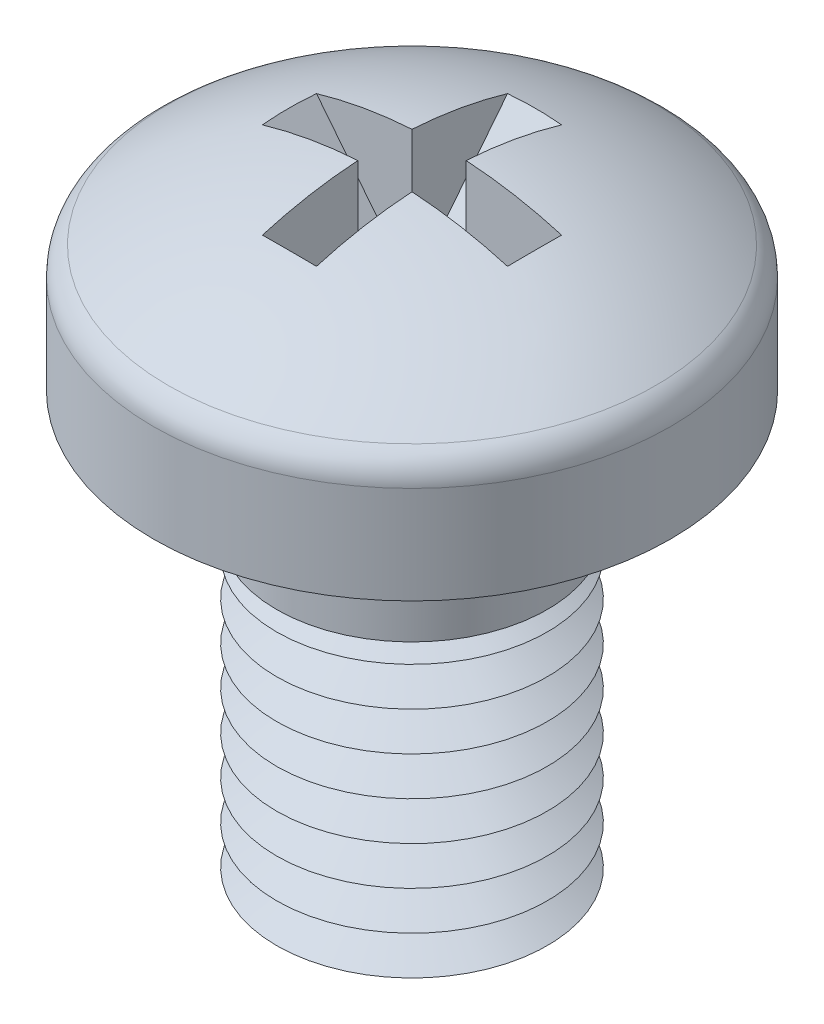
from build123d import *

# Parameters (mm, degrees)
CUT_EXTRUDE1_DEPTH = 0.5
CUT_EXTRUDE2_DEPTH = 0.5


with BuildPart() as part:
    # Sketch1 → Base-Revolve (revolve)
    with BuildSketch(Plane.XY, mode=Mode.PRIVATE) as base_revolve_sk:
        with BuildLine():
            Line((0, 0), (4.776470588, 0))
            Line((4.776470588, 0), (4.776470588, 1.800314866))
            ThreePointArc((4.776470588, 1.800314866), (4.703427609, 2.093884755), (4.501331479, 2.318997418))
            ThreePointArc((4.501331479, 2.318997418), (2.354206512, 3.346986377), (0, 3.7))
            Line((0, 3.7), (0, 0))
        make_face()
    revolve(base_revolve_sk.sketch.rotate(Axis((0, 0, 0), (0, 1, 0)), 90), axis=Axis((0, 0, 0), (0, 1, 0)))

    # Sketch2 → Boss-Revolve1 (revolve)
    with BuildSketch(Plane.XY, mode=Mode.PRIVATE) as boss_revolve1_sk:
        Polygon((0, -8), (1.879225, -8), (2.5, -7.641595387), (1.879225, -7.283190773), (2.5, -6.92478616), (1.879225, -6.566381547), (2.5, -6.207976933), (1.879225, -5.84957232), (2.5, -5.491167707), (1.879225, -5.132763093), (2.5, -4.77435848), (1.879225, -4.415953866), (2.5, -4.057549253), (1.879225, -3.69914464), (2.5, -3.340740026), (1.879225, -2.982335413), (2.5, -2.6239308), (1.879225, -2.265526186), (2.5, -2.265526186), (2.5, 0), (0, 0), align=None)
    revolve(boss_revolve1_sk.sketch.rotate(Axis((0, 0, 0), (0, 1, 0)), 90), axis=Axis((0, 0, 0), (0, 1, 0)))

    # Sketch3 → Cut-Extrude1 (cut, symmetric)
    with BuildSketch(Plane.XY):
        Polygon((-2.535, 5.55), (2.535, 5.55), (2.535, 3.7), (0, 0.5), (-2.535, 3.7), align=None)
    extrude(amount=CUT_EXTRUDE1_DEPTH, both=True, mode=Mode.SUBTRACT)

    # Sketch4 → Cut-Extrude2 (cut, symmetric)
    with BuildSketch(Plane(origin=(0, 0, 0), x_dir=(0, 0, -1), z_dir=(1, 0, 0))):
        Polygon((-2.535, 5.55), (2.535, 5.55), (2.535, 3.7), (0, 0.5), (-2.535, 3.7), align=None)
    extrude(amount=CUT_EXTRUDE2_DEPTH, both=True, mode=Mode.SUBTRACT)


solid = part.part
